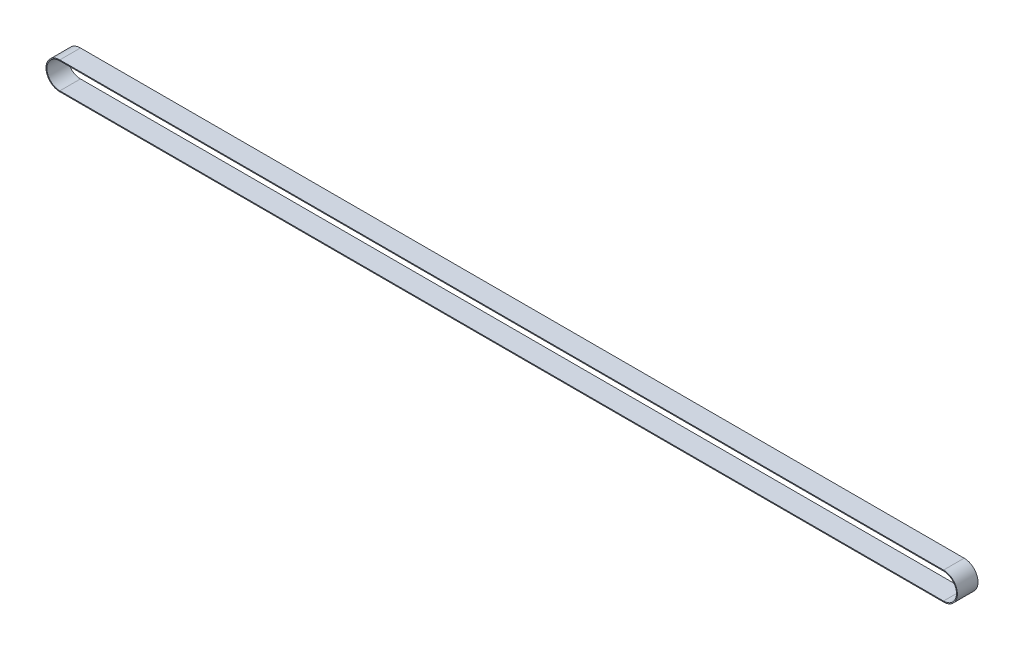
from build123d import *

# Parameters (mm, degrees)
EXTRUDE_THIN1_DEPTH = 17.5


with BuildPart() as part:
    # Sketch2 → Extrude-Thin1 (new, symmetric)
    with BuildSketch(Plane.XY):
        with BuildLine():
            Line((22, 171.5), (1522, 171.5))
            ThreePointArc((1522, 171.5), (1545.5, 148), (1522, 124.5))
            Line((1522, 124.5), (22, 124.5))
            ThreePointArc((22, 124.5), (-1.5, 148), (22, 171.5))
        make_face()
        with BuildLine():
            Line((22, 170), (1522, 170))
            ThreePointArc((1522, 170), (1544, 148), (1522, 126))
            Line((1522, 126), (22, 126))
            ThreePointArc((22, 126), (0, 148), (22, 170))
        make_face(mode=Mode.SUBTRACT)
    extrude(amount=EXTRUDE_THIN1_DEPTH, both=True)


solid = part.part
